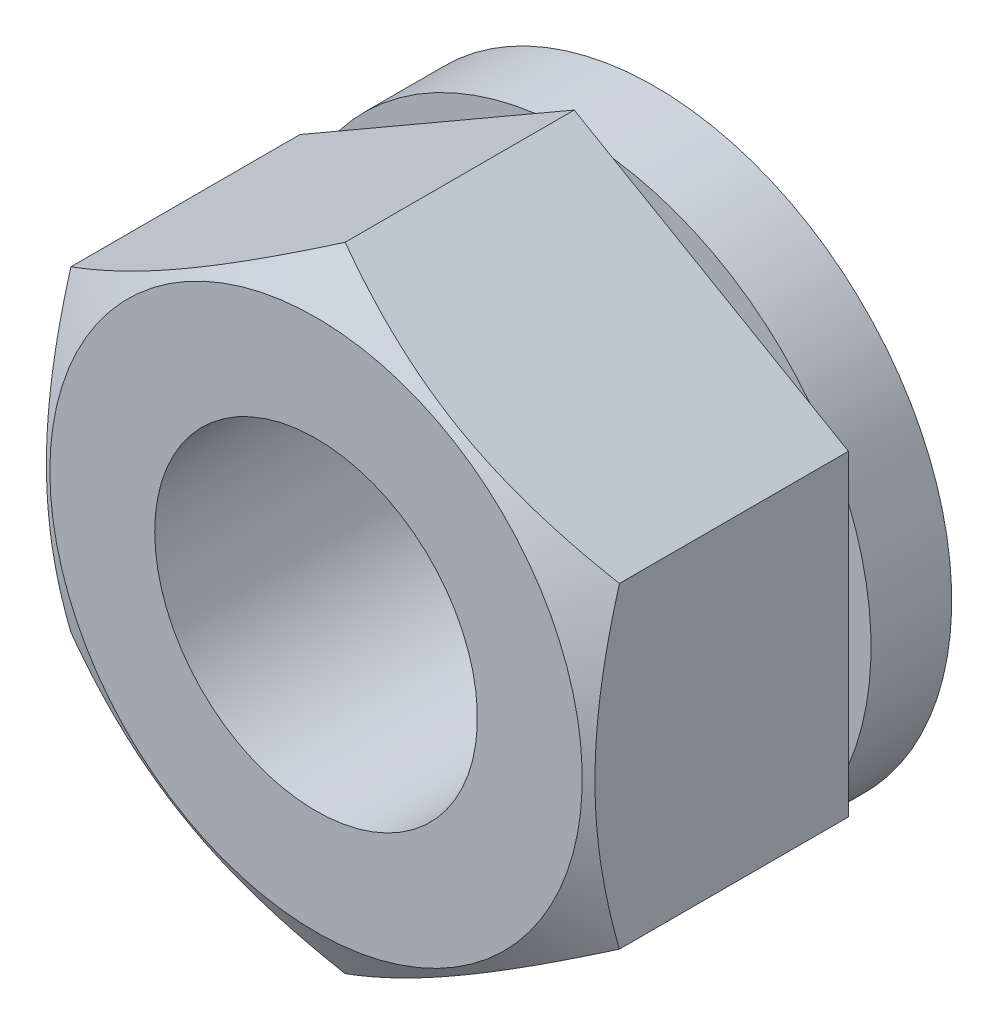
ISO-10303-21;
HEADER;
FILE_DESCRIPTION(('STEP AP214'),'2;1');
FILE_NAME('part.step','',(''),(''),'','','');
FILE_SCHEMA(('AUTOMOTIVE_DESIGN { 1 0 10303 214 1 1 1 1 }'));
ENDSEC;
DATA;
#1=APPLICATION_CONTEXT('core data for automotive mechanical design processes');
#2=APPLICATION_PROTOCOL_DEFINITION('international standard','automotive_design',2000,#1);
#3=PRODUCT_CONTEXT('',#1,'mechanical');
#4=PRODUCT('Part','Part','',(#3));
#5=PRODUCT_RELATED_PRODUCT_CATEGORY('part','',(#4));
#6=PRODUCT_DEFINITION_FORMATION('','',#4);
#7=PRODUCT_DEFINITION_CONTEXT('part definition',#1,'design');
#8=PRODUCT_DEFINITION('design','',#6,#7);
#9=PRODUCT_DEFINITION_SHAPE('','',#8);
#10=(LENGTH_UNIT() NAMED_UNIT(*) SI_UNIT(.MILLI.,.METRE.));
#11=(NAMED_UNIT(*) PLANE_ANGLE_UNIT() SI_UNIT($,.RADIAN.));
#12=(NAMED_UNIT(*) SI_UNIT($,.STERADIAN.) SOLID_ANGLE_UNIT());
#13=UNCERTAINTY_MEASURE_WITH_UNIT(LENGTH_MEASURE(1.E-05),#10,'distance_accuracy_value','');
#14=(GEOMETRIC_REPRESENTATION_CONTEXT(3) GLOBAL_UNCERTAINTY_ASSIGNED_CONTEXT((#13)) GLOBAL_UNIT_ASSIGNED_CONTEXT((#10,
#11,#12)) REPRESENTATION_CONTEXT('',''));
#15=CARTESIAN_POINT('',(0.,0.,0.));
#16=DIRECTION('',(0.,0.,1.));
#17=DIRECTION('',(1.,0.,0.));
#18=AXIS2_PLACEMENT_3D('',#15,#16,#17);
#19=CARTESIAN_POINT('',(0.,0.,-0.5));
#20=DIRECTION('',(0.,0.,1.));
#21=DIRECTION('',(1.,0.,0.));
#22=AXIS2_PLACEMENT_3D('',#19,#20,#21);
#23=CYLINDRICAL_SURFACE('',#22,9.2);
#24=CARTESIAN_POINT('',(0.,0.,2.5));
#25=DIRECTION('',(0.,0.,1.));
#26=DIRECTION('',(1.,0.,0.));
#27=AXIS2_PLACEMENT_3D('',#24,#25,#26);
#28=CIRCLE('',#27,9.2);
#29=CARTESIAN_POINT('',(-7.2983602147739,-5.60124434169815,2.5));
#30=VERTEX_POINT('',#29);
#31=CARTESIAN_POINT('',(-8.49999999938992,-3.51994318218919,2.5));
#32=VERTEX_POINT('',#31);
#33=EDGE_CURVE('E210',#30,#32,#28,.F.);
#34=ORIENTED_EDGE('',*,*,#33,.T.);
#35=CARTESIAN_POINT('',(0.,0.,2.5));
#36=DIRECTION('',(0.,0.,1.));
#37=DIRECTION('',(1.,0.,0.));
#38=AXIS2_PLACEMENT_3D('',#35,#36,#37);
#39=CIRCLE('',#38,9.2);
#40=CARTESIAN_POINT('',(-8.50000000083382,3.5199431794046,2.5));
#41=VERTEX_POINT('',#40);
#42=EDGE_CURVE('E207',#32,#41,#39,.F.);
#43=ORIENTED_EDGE('',*,*,#42,.T.);
#44=CARTESIAN_POINT('',(0.,0.,2.5));
#45=DIRECTION('',(0.,0.,1.));
#46=DIRECTION('',(1.,0.,0.));
#47=AXIS2_PLACEMENT_3D('',#44,#45,#46);
#48=CIRCLE('',#47,9.2);
#49=CARTESIAN_POINT('',(-7.29836021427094,5.60124434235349,2.5));
#50=VERTEX_POINT('',#49);
#51=EDGE_CURVE('E204',#41,#50,#48,.F.);
#52=ORIENTED_EDGE('',*,*,#51,.T.);
#53=CARTESIAN_POINT('',(0.,0.,2.5));
#54=DIRECTION('',(0.,0.,1.));
#55=DIRECTION('',(1.,0.,0.));
#56=AXIS2_PLACEMENT_3D('',#53,#54,#55);
#57=CIRCLE('',#56,9.2);
#58=CARTESIAN_POINT('',(-1.20163978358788,9.1211875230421,2.5));
#59=VERTEX_POINT('',#58);
#60=EDGE_CURVE('E201',#50,#59,#57,.F.);
#61=ORIENTED_EDGE('',*,*,#60,.T.);
#62=CARTESIAN_POINT('',(0.,0.,2.5));
#63=DIRECTION('',(0.,0.,1.));
#64=DIRECTION('',(1.,0.,0.));
#65=AXIS2_PLACEMENT_3D('',#62,#63,#64);
#66=CIRCLE('',#65,9.2);
#67=CARTESIAN_POINT('',(1.20163978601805,9.12118752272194,2.5));
#68=VERTEX_POINT('',#67);
#69=EDGE_CURVE('E198',#59,#68,#66,.F.);
#70=ORIENTED_EDGE('',*,*,#69,.T.);
#71=CARTESIAN_POINT('',(0.,0.,2.5));
#72=DIRECTION('',(0.,0.,1.));
#73=DIRECTION('',(1.,0.,0.));
#74=AXIS2_PLACEMENT_3D('',#71,#72,#73);
#75=CIRCLE('',#74,9.2);
#76=CARTESIAN_POINT('',(7.29836021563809,5.60124434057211,2.5));
#77=VERTEX_POINT('',#76);
#78=EDGE_CURVE('E195',#68,#77,#75,.F.);
#79=ORIENTED_EDGE('',*,*,#78,.T.);
#80=CARTESIAN_POINT('',(0.,0.,2.5));
#81=DIRECTION('',(0.,0.,1.));
#82=DIRECTION('',(1.,0.,0.));
#83=AXIS2_PLACEMENT_3D('',#80,#81,#82);
#84=CIRCLE('',#83,9.2);
#85=CARTESIAN_POINT('',(8.5,3.51994318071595,2.5));
#86=VERTEX_POINT('',#85);
#87=EDGE_CURVE('E193',#77,#86,#84,.F.);
#88=ORIENTED_EDGE('',*,*,#87,.T.);
#89=CARTESIAN_POINT('',(0.,0.,2.5));
#90=DIRECTION('',(0.,0.,1.));
#91=DIRECTION('',(1.,0.,0.));
#92=AXIS2_PLACEMENT_3D('',#89,#90,#91);
#93=CIRCLE('',#92,9.2);
#94=CARTESIAN_POINT('',(8.4999999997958,-3.51994318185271,2.5));
#95=VERTEX_POINT('',#94);
#96=EDGE_CURVE('E23',#86,#95,#93,.F.);
#97=ORIENTED_EDGE('',*,*,#96,.T.);
#98=CARTESIAN_POINT('',(0.,0.,2.5));
#99=DIRECTION('',(0.,0.,1.));
#100=DIRECTION('',(1.,0.,0.));
#101=AXIS2_PLACEMENT_3D('',#98,#99,#100);
#102=CIRCLE('',#101,9.2);
#103=CARTESIAN_POINT('',(7.2983602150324,-5.60124434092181,2.5));
#104=VERTEX_POINT('',#103);
#105=EDGE_CURVE('E112',#95,#104,#102,.F.);
#106=ORIENTED_EDGE('',*,*,#105,.T.);
#107=CARTESIAN_POINT('',(0.,0.,2.5));
#108=DIRECTION('',(0.,0.,1.));
#109=DIRECTION('',(1.,0.,0.));
#110=AXIS2_PLACEMENT_3D('',#107,#108,#109);
#111=CIRCLE('',#110,9.2);
#112=CARTESIAN_POINT('',(1.20163978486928,-9.12118752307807,2.5));
#113=VERTEX_POINT('',#112);
#114=EDGE_CURVE('E116',#104,#113,#111,.F.);
#115=ORIENTED_EDGE('',*,*,#114,.T.);
#116=CARTESIAN_POINT('',(0.,0.,2.5));
#117=DIRECTION('',(0.,0.,1.));
#118=DIRECTION('',(1.,0.,0.));
#119=AXIS2_PLACEMENT_3D('',#116,#117,#118);
#120=CIRCLE('',#119,9.2);
#121=CARTESIAN_POINT('',(-1.20163978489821,-9.12118752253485,2.5));
#122=VERTEX_POINT('',#121);
#123=EDGE_CURVE('E120',#113,#122,#120,.F.);
#124=ORIENTED_EDGE('',*,*,#123,.T.);
#125=CARTESIAN_POINT('',(0.,0.,2.5));
#126=DIRECTION('',(0.,0.,1.));
#127=DIRECTION('',(1.,0.,0.));
#128=AXIS2_PLACEMENT_3D('',#125,#126,#127);
#129=CIRCLE('',#128,9.2);
#130=EDGE_CURVE('E212',#122,#30,#129,.F.);
#131=ORIENTED_EDGE('',*,*,#130,.T.);
#132=EDGE_LOOP('',(#34,#43,#52,#61,#70,#79,#88,#97,#106,#115,#124,#131));
#133=FACE_BOUND('',#132,.T.);
#134=CARTESIAN_POINT('',(0.,0.,0.));
#135=DIRECTION('',(0.,0.,-1.));
#136=DIRECTION('',(-1.,0.,0.));
#137=AXIS2_PLACEMENT_3D('',#134,#135,#136);
#138=CIRCLE('',#137,9.2);
#139=CARTESIAN_POINT('',(-9.2,0.,0.));
#140=VERTEX_POINT('',#139);
#141=EDGE_CURVE('E540',#140,#140,#138,.T.);
#142=ORIENTED_EDGE('',*,*,#141,.F.);
#143=EDGE_LOOP('',(#142));
#144=FACE_BOUND('',#143,.T.);
#145=ADVANCED_FACE('F14',(#133,#144),#23,.T.);
#146=CARTESIAN_POINT('',(0.,0.,2.5));
#147=DIRECTION('',(0.,0.,-1.));
#148=DIRECTION('',(-1.,0.,0.));
#149=AXIS2_PLACEMENT_3D('',#146,#147,#148);
#150=CYLINDRICAL_SURFACE('',#149,5.1);
#151=CARTESIAN_POINT('',(0.,0.,2.5));
#152=DIRECTION('',(0.,0.,-1.));
#153=DIRECTION('',(-1.,0.,0.));
#154=AXIS2_PLACEMENT_3D('',#151,#152,#153);
#155=CIRCLE('',#154,5.1);
#156=CARTESIAN_POINT('',(-5.1,0.,2.5));
#157=VERTEX_POINT('',#156);
#158=EDGE_CURVE('E536',#157,#157,#155,.T.);
#159=ORIENTED_EDGE('',*,*,#158,.F.);
#160=EDGE_LOOP('',(#159));
#161=FACE_BOUND('',#160,.T.);
#162=CARTESIAN_POINT('',(0.,0.,0.));
#163=DIRECTION('',(0.,0.,-1.));
#164=DIRECTION('',(-1.,0.,0.));
#165=AXIS2_PLACEMENT_3D('',#162,#163,#164);
#166=CIRCLE('',#165,5.1);
#167=CARTESIAN_POINT('',(-5.1,0.,0.));
#168=VERTEX_POINT('',#167);
#169=EDGE_CURVE('E18',#168,#168,#166,.F.);
#170=ORIENTED_EDGE('',*,*,#169,.F.);
#171=EDGE_LOOP('',(#170));
#172=FACE_BOUND('',#171,.T.);
#173=ADVANCED_FACE('F280',(#161,#172),#150,.F.);
#174=CARTESIAN_POINT('',(0.,0.,10.5));
#175=DIRECTION('',(0.,0.,-1.));
#176=DIRECTION('',(-1.,0.,0.));
#177=AXIS2_PLACEMENT_3D('',#174,#175,#176);
#178=CYLINDRICAL_SURFACE('',#177,5.);
#179=CARTESIAN_POINT('',(0.,0.,10.5));
#180=DIRECTION('',(0.,0.,-1.));
#181=DIRECTION('',(-1.,0.,0.));
#182=AXIS2_PLACEMENT_3D('',#179,#180,#181);
#183=CIRCLE('',#182,5.);
#184=CARTESIAN_POINT('',(-5.,0.,10.5));
#185=VERTEX_POINT('',#184);
#186=EDGE_CURVE('E158',#185,#185,#183,.T.);
#187=ORIENTED_EDGE('',*,*,#186,.F.);
#188=EDGE_LOOP('',(#187));
#189=FACE_BOUND('',#188,.T.);
#190=CARTESIAN_POINT('',(0.,0.,2.5));
#191=DIRECTION('',(0.,0.,-1.));
#192=DIRECTION('',(-1.,0.,0.));
#193=AXIS2_PLACEMENT_3D('',#190,#191,#192);
#194=CIRCLE('',#193,5.);
#195=CARTESIAN_POINT('',(-5.,0.,2.5));
#196=VERTEX_POINT('',#195);
#197=EDGE_CURVE('E533',#196,#196,#194,.T.);
#198=ORIENTED_EDGE('',*,*,#197,.T.);
#199=EDGE_LOOP('',(#198));
#200=FACE_BOUND('',#199,.T.);
#201=ADVANCED_FACE('F286',(#189,#200),#178,.F.);
#202=CARTESIAN_POINT('',(8.5,-9.932734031,10.5));
#203=DIRECTION('',(0.,0.,-1.));
#204=DIRECTION('',(-1.,0.,0.));
#205=AXIS2_PLACEMENT_3D('',#202,#203,#204);
#206=PLANE('',#205);
#207=CARTESIAN_POINT('',(0.,0.,10.5));
#208=DIRECTION('',(0.,0.,-1.));
#209=DIRECTION('',(-1.,0.,0.));
#210=AXIS2_PLACEMENT_3D('',#207,#208,#209);
#211=CIRCLE('',#210,8.25);
#212=CARTESIAN_POINT('',(-8.25,0.,10.5));
#213=VERTEX_POINT('',#212);
#214=EDGE_CURVE('E538',#213,#213,#211,.T.);
#215=ORIENTED_EDGE('',*,*,#214,.F.);
#216=EDGE_LOOP('',(#215));
#217=FACE_BOUND('',#216,.T.);
#218=ORIENTED_EDGE('',*,*,#186,.T.);
#219=EDGE_LOOP('',(#218));
#220=FACE_BOUND('',#219,.T.);
#221=ADVANCED_FACE('F291',(#217,#220),#206,.F.);
#222=CARTESIAN_POINT('',(8.5,-4.907477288,2.5));
#223=DIRECTION('',(-0.499999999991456,0.866025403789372,0.));
#224=DIRECTION('',(-0.866025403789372,-0.499999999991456,0.));
#225=AXIS2_PLACEMENT_3D('',#222,#223,#224);
#226=PLANE('',#225);
#227=DIRECTION('',(0.,0.,1.));
#228=VECTOR('',#227,1.);
#229=CARTESIAN_POINT('',(8.5,-4.907477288,6.5));
#230=LINE('',#229,#228);
#231=CARTESIAN_POINT('',(8.5,-4.90747728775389,2.5));
#232=VERTEX_POINT('',#231);
#233=CARTESIAN_POINT('',(8.5,-4.907477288,9.59647305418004));
#234=VERTEX_POINT('',#233);
#235=EDGE_CURVE('E165',#232,#234,#230,.T.);
#236=ORIENTED_EDGE('',*,*,#235,.T.);
#237=CARTESIAN_POINT('',(8.5003,-4.90730408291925,9.59637305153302));
#238=CARTESIAN_POINT('',(8.31345993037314,-5.01517624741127,9.65864433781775));
#239=CARTESIAN_POINT('',(8.12592325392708,-5.12345059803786,9.71808959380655));
#240=CARTESIAN_POINT('',(7.74932684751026,-5.3408786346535,9.83054966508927));
#241=CARTESIAN_POINT('',(7.5602664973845,-5.45003267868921,9.88356170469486));
#242=CARTESIAN_POINT('',(6.99005829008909,-5.77924254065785,10.0319073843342));
#243=CARTESIAN_POINT('',(6.60665954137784,-6.00059791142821,10.1162849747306));
#244=CARTESIAN_POINT('',(6.03291070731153,-6.33185195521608,10.2152285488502));
#245=CARTESIAN_POINT('',(5.84427473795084,-6.44076098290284,10.2434148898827));
#246=CARTESIAN_POINT('',(5.46614968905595,-6.65907158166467,10.2906790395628));
#247=CARTESIAN_POINT('',(5.27666068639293,-6.76847310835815,10.309757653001));
#248=CARTESIAN_POINT('',(4.89735637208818,-6.98746455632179,10.338322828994));
#249=CARTESIAN_POINT('',(4.70754167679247,-7.09705412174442,10.3478202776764));
#250=CARTESIAN_POINT('',(4.32773688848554,-7.31633451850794,10.3570195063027));
#251=CARTESIAN_POINT('',(4.13774680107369,-7.42602534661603,10.3567215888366));
#252=CARTESIAN_POINT('',(3.78254745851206,-7.63109978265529,10.3470110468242));
#253=CARTESIAN_POINT('',(3.61731314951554,-7.72649785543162,10.3387829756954));
#254=CARTESIAN_POINT('',(3.28723151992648,-7.91707057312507,10.3150774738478));
#255=CARTESIAN_POINT('',(3.12238422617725,-8.0122452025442,10.2995995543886));
#256=CARTESIAN_POINT('',(2.62848051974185,-8.29740064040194,10.24265690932));
#257=CARTESIAN_POINT('',(2.30029837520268,-8.48687668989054,10.1906904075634));
#258=CARTESIAN_POINT('',(1.64045254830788,-8.86783885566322,10.0607720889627));
#259=CARTESIAN_POINT('',(1.30887308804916,-9.05927634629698,9.9822694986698));
#260=CARTESIAN_POINT('',(0.650659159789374,-9.43929633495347,9.80410061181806));
#261=CARTESIAN_POINT('',(0.324016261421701,-9.62788370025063,9.70447616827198));
#262=CARTESIAN_POINT('',(-0.000300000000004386,-9.81512778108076,9.59637305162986));
#263=B_SPLINE_CURVE_WITH_KNOTS('',3,(#237,#238,#239,#240,#241,#242,#243,#244,#245,#246,#247,
#248,#249,#250,#251,#252,#253,#254,#255,#256,#257,#258,#259,#260,#261,#262),.UNSPECIFIED.,.F.,
.F.,(4,2,2,2,2,2,2,2,2,2,2,2,4),(0.,0.673600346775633,1.3474903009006,2.69807034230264,
3.35681955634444,4.01551055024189,4.67345229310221,5.33137371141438,5.90415137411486,
6.4769676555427,7.62341628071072,8.79529237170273,9.96486773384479),.UNSPECIFIED.);
#264=CARTESIAN_POINT('',(0.,-9.814954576,9.59647305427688));
#265=VERTEX_POINT('',#264);
#266=EDGE_CURVE('E31',#234,#265,#263,.T.);
#267=ORIENTED_EDGE('',*,*,#266,.T.);
#268=DIRECTION('',(0.,0.,-1.));
#269=VECTOR('',#268,1.);
#270=CARTESIAN_POINT('',(0.,-9.814954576,6.5));
#271=LINE('',#270,#269);
#272=CARTESIAN_POINT('',(5.49695380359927E-11,-9.8149545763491,2.5));
#273=VERTEX_POINT('',#272);
#274=EDGE_CURVE('E162',#265,#273,#271,.T.);
#275=ORIENTED_EDGE('',*,*,#274,.T.);
#276=DIRECTION('',(-0.866025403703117,-0.500000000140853,0.));
#277=VECTOR('',#276,1.);
#278=CARTESIAN_POINT('',(1.20163978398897,-9.12118752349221,2.5));
#279=LINE('',#278,#277);
#280=EDGE_CURVE('E103',#113,#273,#279,.T.);
#281=ORIENTED_EDGE('',*,*,#280,.F.);
#282=DIRECTION('',(-0.866025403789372,-0.499999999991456,0.));
#283=VECTOR('',#282,1.);
#284=CARTESIAN_POINT('',(8.5,-4.907477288,2.5));
#285=LINE('',#284,#283);
#286=EDGE_CURVE('E96',#113,#104,#285,.F.);
#287=ORIENTED_EDGE('',*,*,#286,.T.);
#288=DIRECTION('',(-0.866025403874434,-0.499999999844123,0.));
#289=VECTOR('',#288,1.);
#290=CARTESIAN_POINT('',(8.5,-4.90747728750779,2.5));
#291=LINE('',#290,#289);
#292=EDGE_CURVE('E100',#232,#104,#291,.T.);
#293=ORIENTED_EDGE('',*,*,#292,.F.);
#294=EDGE_LOOP('',(#236,#267,#275,#281,#287,#293));
#295=FACE_BOUND('',#294,.T.);
#296=ADVANCED_FACE('F99',(#295),#226,.F.);
#297=CARTESIAN_POINT('',(0.,-9.814954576,2.5));
#298=DIRECTION('',(0.499999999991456,0.866025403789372,0.));
#299=DIRECTION('',(-0.866025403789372,0.499999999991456,0.));
#300=AXIS2_PLACEMENT_3D('',#297,#298,#299);
#301=PLANE('',#300);
#302=ORIENTED_EDGE('',*,*,#274,.F.);
#303=CARTESIAN_POINT('',(0.000300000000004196,-9.81512778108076,9.59637305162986));
#304=CARTESIAN_POINT('',(-0.186540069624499,-9.7072556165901,9.65864433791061));
#305=CARTESIAN_POINT('',(-0.374076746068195,-9.59898126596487,9.71808959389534));
#306=CARTESIAN_POINT('',(-0.75067315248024,-9.38155322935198,9.83054966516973));
#307=CARTESIAN_POINT('',(-0.93973350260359,-9.27239918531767,9.88356170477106));
#308=CARTESIAN_POINT('',(-1.50994170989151,-8.94318932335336,10.0319073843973));
#309=CARTESIAN_POINT('',(-1.89334045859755,-8.721833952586,10.1162849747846));
#310=CARTESIAN_POINT('',(-2.46708929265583,-8.39057990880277,10.2152285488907));
#311=CARTESIAN_POINT('',(-2.6557252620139,-8.28167088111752,10.2434148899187));
#312=CARTESIAN_POINT('',(-3.03385031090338,-8.06336028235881,10.29067903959));
#313=CARTESIAN_POINT('',(-3.22333931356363,-7.95395875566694,10.3097576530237));
#314=CARTESIAN_POINT('',(-3.60264362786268,-7.73496730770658,10.3383228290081));
#315=CARTESIAN_POINT('',(-3.79245832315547,-7.62537774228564,10.3478202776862));
#316=CARTESIAN_POINT('',(-4.1722631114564,-7.40609734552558,10.3570195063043));
#317=CARTESIAN_POINT('',(-4.36225319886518,-7.29640651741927,10.3567215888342));
#318=CARTESIAN_POINT('',(-4.71745254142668,-7.09133208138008,10.3470110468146));
#319=CARTESIAN_POINT('',(-4.88268685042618,-6.99593400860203,10.3387829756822));
#320=CARTESIAN_POINT('',(-5.21276848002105,-6.80536129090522,10.3150774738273));
#321=CARTESIAN_POINT('',(-5.37761577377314,-6.71018666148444,10.2995995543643));
#322=CARTESIAN_POINT('',(-5.87151948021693,-6.42503122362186,10.2426569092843));
#323=CARTESIAN_POINT('',(-6.19970162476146,-6.23555517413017,10.19069040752));
#324=CARTESIAN_POINT('',(-6.85954745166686,-5.85459300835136,10.0607720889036));
#325=CARTESIAN_POINT('',(-7.19112691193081,-5.66315551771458,9.98226949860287));
#326=CARTESIAN_POINT('',(-7.84934084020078,-5.28313552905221,9.80410061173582));
#327=CARTESIAN_POINT('',(-8.17598373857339,-5.0945481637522,9.70447616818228));
#328=CARTESIAN_POINT('',(-8.5003,-4.90730408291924,9.59637305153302));
#329=B_SPLINE_CURVE_WITH_KNOTS('',3,(#303,#304,#305,#306,#307,#308,#309,#310,#311,#312,#313,
#314,#315,#316,#317,#318,#319,#320,#321,#322,#323,#324,#325,#326,#327,#328),.UNSPECIFIED.,.F.,
.F.,(4,2,2,2,2,2,2,2,2,2,2,2,4),(0.,0.673600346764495,1.34749030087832,2.69807034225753,
3.3568195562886,4.01551055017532,4.67345229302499,5.33137371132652,5.90415137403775,
6.47696765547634,7.62341628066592,8.79529237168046,9.9648677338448),.UNSPECIFIED.);
#330=CARTESIAN_POINT('',(-8.5,-4.907477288,9.59647305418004));
#331=VERTEX_POINT('',#330);
#332=EDGE_CURVE('E308',#265,#331,#329,.T.);
#333=ORIENTED_EDGE('',*,*,#332,.T.);
#334=DIRECTION('',(0.,0.,-1.));
#335=VECTOR('',#334,1.);
#336=CARTESIAN_POINT('',(-8.5,-4.907477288,6.5));
#337=LINE('',#336,#335);
#338=CARTESIAN_POINT('',(-8.5,-4.90747728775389,2.5));
#339=VERTEX_POINT('',#338);
#340=EDGE_CURVE('E161',#331,#339,#337,.T.);
#341=ORIENTED_EDGE('',*,*,#340,.T.);
#342=DIRECTION('',(-0.866025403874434,0.499999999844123,0.));
#343=VECTOR('',#342,1.);
#344=CARTESIAN_POINT('',(-7.2983602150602,-5.60124434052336,2.5));
#345=LINE('',#344,#343);
#346=EDGE_CURVE('E148',#30,#339,#345,.T.);
#347=ORIENTED_EDGE('',*,*,#346,.F.);
#348=DIRECTION('',(-0.866025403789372,0.499999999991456,0.));
#349=VECTOR('',#348,1.);
#350=CARTESIAN_POINT('',(0.,-9.814954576,2.5));
#351=LINE('',#350,#349);
#352=EDGE_CURVE('E152',#30,#122,#351,.F.);
#353=ORIENTED_EDGE('',*,*,#352,.T.);
#354=DIRECTION('',(-0.866025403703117,0.500000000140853,0.));
#355=VECTOR('',#354,1.);
#356=CARTESIAN_POINT('',(0.,-9.81495457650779,2.5));
#357=LINE('',#356,#355);
#358=EDGE_CURVE('E154',#273,#122,#357,.T.);
#359=ORIENTED_EDGE('',*,*,#358,.F.);
#360=EDGE_LOOP('',(#302,#333,#341,#347,#353,#359));
#361=FACE_BOUND('',#360,.T.);
#362=ADVANCED_FACE('F299',(#361),#301,.F.);
#363=CARTESIAN_POINT('',(-8.5,-4.907477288,10.5));
#364=DIRECTION('',(1.,0.,0.));
#365=DIRECTION('',(0.,0.,-1.));
#366=AXIS2_PLACEMENT_3D('',#363,#364,#365);
#367=PLANE('',#366);
#368=ORIENTED_EDGE('',*,*,#340,.F.);
#369=CARTESIAN_POINT('',(-8.5,-4.907777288,9.5963864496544));
#370=CARTESIAN_POINT('',(-8.5,-4.69203334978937,9.65865718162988));
#371=CARTESIAN_POINT('',(-8.5,-4.47548504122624,9.71810186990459));
#372=CARTESIAN_POINT('',(-8.5,-4.04062976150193,9.83056078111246));
#373=CARTESIAN_POINT('',(-8.5,-3.82232207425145,9.88357222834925));
#374=CARTESIAN_POINT('',(-8.5,-3.16390359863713,10.031916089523));
#375=CARTESIAN_POINT('',(-8.5,-2.72119372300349,10.1162924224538));
#376=CARTESIAN_POINT('',(-8.5,-2.05868693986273,10.2152341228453));
#377=CARTESIAN_POINT('',(-8.5,-1.8408692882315,10.243419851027));
#378=CARTESIAN_POINT('',(-8.5,-1.40424892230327,10.2906827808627));
#379=CARTESIAN_POINT('',(-8.5,-1.18544629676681,10.309760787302));
#380=CARTESIAN_POINT('',(-8.5,-0.747464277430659,10.3383247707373));
#381=CARTESIAN_POINT('',(-8.5,-0.528285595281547,10.3478216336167));
#382=CARTESIAN_POINT('',(-8.5,-0.0897257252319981,10.3570197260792));
#383=CARTESIAN_POINT('',(-8.5,0.129655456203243,10.35672125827));
#384=CARTESIAN_POINT('',(-8.5,0.539800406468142,10.3470098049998));
#385=CARTESIAN_POINT('',(-8.5,0.730593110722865,10.3387814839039));
#386=CARTESIAN_POINT('',(-8.5,1.11173166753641,10.3150757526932));
#387=CARTESIAN_POINT('',(-8.5,1.30207748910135,10.2995978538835));
#388=CARTESIAN_POINT('',(-8.5,1.87237805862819,10.2426556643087));
#389=CARTESIAN_POINT('',(-8.5,2.25132331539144,10.1906899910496));
#390=CARTESIAN_POINT('',(-8.5,3.01323376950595,10.0607742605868));
#391=CARTESIAN_POINT('',(-8.5,3.39610172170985,9.98227346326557));
#392=CARTESIAN_POINT('',(-8.5,4.1561278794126,9.8041088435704));
#393=CARTESIAN_POINT('',(-8.5,4.53329581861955,9.70448687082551));
#394=CARTESIAN_POINT('',(-8.5,4.907777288,9.5963864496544));
#395=B_SPLINE_CURVE_WITH_KNOTS('',3,(#369,#370,#371,#372,#373,#374,#375,#376,#377,#378,#379,
#380,#381,#382,#383,#384,#385,#386,#387,#388,#389,#390,#391,#392,#393,#394),.UNSPECIFIED.,.F.,
.F.,(4,2,2,2,2,2,2,2,2,2,2,2,4),(0.,0.673598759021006,1.34748712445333,2.69806390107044,
3.35681167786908,4.01550123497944,4.67344155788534,5.33136155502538,5.90412894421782,
6.47693494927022,7.62336295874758,8.79521734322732,9.96477115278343),.UNSPECIFIED.);
#396=CARTESIAN_POINT('',(-8.5,4.907477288,9.59647305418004));
#397=VERTEX_POINT('',#396);
#398=EDGE_CURVE('E339',#331,#397,#395,.T.);
#399=ORIENTED_EDGE('',*,*,#398,.T.);
#400=DIRECTION('',(0.,0.,-1.));
#401=VECTOR('',#400,1.);
#402=CARTESIAN_POINT('',(-8.5,4.907477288,6.5));
#403=LINE('',#402,#401);
#404=CARTESIAN_POINT('',(-8.5,4.90747728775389,2.5));
#405=VERTEX_POINT('',#404);
#406=EDGE_CURVE('E182',#397,#405,#403,.T.);
#407=ORIENTED_EDGE('',*,*,#406,.T.);
#408=DIRECTION('',(0.,1.,0.));
#409=VECTOR('',#408,1.);
#410=CARTESIAN_POINT('',(-8.5,4.560593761,2.5));
#411=LINE('',#410,#409);
#412=EDGE_CURVE('E147',#41,#405,#411,.T.);
#413=ORIENTED_EDGE('',*,*,#412,.F.);
#414=DIRECTION('',(0.,-1.,0.));
#415=VECTOR('',#414,1.);
#416=CARTESIAN_POINT('',(-8.5,0.,2.5));
#417=LINE('',#416,#415);
#418=EDGE_CURVE('E233',#41,#32,#417,.T.);
#419=ORIENTED_EDGE('',*,*,#418,.T.);
#420=DIRECTION('',(0.,1.,0.));
#421=VECTOR('',#420,1.);
#422=CARTESIAN_POINT('',(-8.5,-4.560593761,2.5));
#423=LINE('',#422,#421);
#424=EDGE_CURVE('E151',#339,#32,#423,.T.);
#425=ORIENTED_EDGE('',*,*,#424,.F.);
#426=EDGE_LOOP('',(#368,#399,#407,#413,#419,#425));
#427=FACE_BOUND('',#426,.T.);
#428=ADVANCED_FACE('F236',(#427),#367,.F.);
#429=CARTESIAN_POINT('',(-8.5,4.907477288,2.5));
#430=DIRECTION('',(0.499999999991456,-0.866025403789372,0.));
#431=DIRECTION('',(0.866025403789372,0.499999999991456,0.));
#432=AXIS2_PLACEMENT_3D('',#429,#430,#431);
#433=PLANE('',#432);
#434=ORIENTED_EDGE('',*,*,#406,.F.);
#435=CARTESIAN_POINT('',(-8.5003,4.90730408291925,9.59637305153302));
#436=CARTESIAN_POINT('',(-8.31345993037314,5.01517624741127,9.65864433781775));
#437=CARTESIAN_POINT('',(-8.12592325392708,5.12345059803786,9.71808959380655));
#438=CARTESIAN_POINT('',(-7.74932684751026,5.3408786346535,9.83054966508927));
#439=CARTESIAN_POINT('',(-7.5602664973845,5.45003267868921,9.88356170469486));
#440=CARTESIAN_POINT('',(-6.99005829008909,5.77924254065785,10.0319073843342));
#441=CARTESIAN_POINT('',(-6.60665954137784,6.00059791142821,10.1162849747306));
#442=CARTESIAN_POINT('',(-6.03291070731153,6.33185195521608,10.2152285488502));
#443=CARTESIAN_POINT('',(-5.84427473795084,6.44076098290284,10.2434148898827));
#444=CARTESIAN_POINT('',(-5.46614968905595,6.65907158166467,10.2906790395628));
#445=CARTESIAN_POINT('',(-5.27666068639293,6.76847310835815,10.309757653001));
#446=CARTESIAN_POINT('',(-4.89735637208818,6.98746455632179,10.338322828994));
#447=CARTESIAN_POINT('',(-4.70754167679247,7.09705412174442,10.3478202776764));
#448=CARTESIAN_POINT('',(-4.32773688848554,7.31633451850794,10.3570195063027));
#449=CARTESIAN_POINT('',(-4.13774680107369,7.42602534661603,10.3567215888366));
#450=CARTESIAN_POINT('',(-3.78254745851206,7.63109978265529,10.3470110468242));
#451=CARTESIAN_POINT('',(-3.61731314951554,7.72649785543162,10.3387829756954));
#452=CARTESIAN_POINT('',(-3.28723151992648,7.91707057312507,10.3150774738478));
#453=CARTESIAN_POINT('',(-3.12238422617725,8.0122452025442,10.2995995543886));
#454=CARTESIAN_POINT('',(-2.62848051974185,8.29740064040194,10.24265690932));
#455=CARTESIAN_POINT('',(-2.30029837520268,8.48687668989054,10.1906904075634));
#456=CARTESIAN_POINT('',(-1.64045254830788,8.86783885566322,10.0607720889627));
#457=CARTESIAN_POINT('',(-1.30887308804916,9.05927634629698,9.9822694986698));
#458=CARTESIAN_POINT('',(-0.650659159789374,9.43929633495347,9.80410061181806));
#459=CARTESIAN_POINT('',(-0.324016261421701,9.62788370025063,9.70447616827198));
#460=CARTESIAN_POINT('',(0.000300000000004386,9.81512778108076,9.59637305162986));
#461=B_SPLINE_CURVE_WITH_KNOTS('',3,(#435,#436,#437,#438,#439,#440,#441,#442,#443,#444,#445,
#446,#447,#448,#449,#450,#451,#452,#453,#454,#455,#456,#457,#458,#459,#460),.UNSPECIFIED.,.F.,
.F.,(4,2,2,2,2,2,2,2,2,2,2,2,4),(0.,0.673600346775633,1.3474903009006,2.69807034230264,
3.35681955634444,4.01551055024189,4.67345229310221,5.33137371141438,5.90415137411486,
6.4769676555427,7.62341628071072,8.79529237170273,9.96486773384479),.UNSPECIFIED.);
#462=CARTESIAN_POINT('',(0.,9.814954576,9.59647305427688));
#463=VERTEX_POINT('',#462);
#464=EDGE_CURVE('E333',#397,#463,#461,.T.);
#465=ORIENTED_EDGE('',*,*,#464,.T.);
#466=DIRECTION('',(0.,0.,-1.));
#467=VECTOR('',#466,1.);
#468=CARTESIAN_POINT('',(0.,9.814954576,6.5));
#469=LINE('',#468,#467);
#470=CARTESIAN_POINT('',(5.49693636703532E-11,9.8149545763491,2.5));
#471=VERTEX_POINT('',#470);
#472=EDGE_CURVE('E180',#463,#471,#469,.T.);
#473=ORIENTED_EDGE('',*,*,#472,.T.);
#474=DIRECTION('',(0.866025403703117,0.500000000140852,0.));
#475=VECTOR('',#474,1.);
#476=CARTESIAN_POINT('',(-1.20163978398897,9.12118752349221,2.5));
#477=LINE('',#476,#475);
#478=EDGE_CURVE('E139',#59,#471,#477,.T.);
#479=ORIENTED_EDGE('',*,*,#478,.F.);
#480=DIRECTION('',(0.866025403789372,0.499999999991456,0.));
#481=VECTOR('',#480,1.);
#482=CARTESIAN_POINT('',(-8.5,4.907477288,2.5));
#483=LINE('',#482,#481);
#484=EDGE_CURVE('E142',#59,#50,#483,.F.);
#485=ORIENTED_EDGE('',*,*,#484,.T.);
#486=DIRECTION('',(0.866025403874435,0.499999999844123,0.));
#487=VECTOR('',#486,1.);
#488=CARTESIAN_POINT('',(-8.5,4.90747728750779,2.5));
#489=LINE('',#488,#487);
#490=EDGE_CURVE('E144',#405,#50,#489,.T.);
#491=ORIENTED_EDGE('',*,*,#490,.F.);
#492=EDGE_LOOP('',(#434,#465,#473,#479,#485,#491));
#493=FACE_BOUND('',#492,.T.);
#494=ADVANCED_FACE('F261',(#493),#433,.F.);
#495=CARTESIAN_POINT('',(0.,9.814954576,2.5));
#496=DIRECTION('',(-0.499999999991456,-0.866025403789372,0.));
#497=DIRECTION('',(0.866025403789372,-0.499999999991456,0.));
#498=AXIS2_PLACEMENT_3D('',#495,#496,#497);
#499=PLANE('',#498);
#500=ORIENTED_EDGE('',*,*,#472,.F.);
#501=CARTESIAN_POINT('',(-0.000300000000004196,9.81512778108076,9.59637305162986));
#502=CARTESIAN_POINT('',(0.186540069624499,9.7072556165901,9.65864433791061));
#503=CARTESIAN_POINT('',(0.374076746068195,9.59898126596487,9.71808959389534));
#504=CARTESIAN_POINT('',(0.75067315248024,9.38155322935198,9.83054966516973));
#505=CARTESIAN_POINT('',(0.93973350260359,9.27239918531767,9.88356170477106));
#506=CARTESIAN_POINT('',(1.50994170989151,8.94318932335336,10.0319073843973));
#507=CARTESIAN_POINT('',(1.89334045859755,8.721833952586,10.1162849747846));
#508=CARTESIAN_POINT('',(2.46708929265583,8.39057990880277,10.2152285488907));
#509=CARTESIAN_POINT('',(2.6557252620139,8.28167088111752,10.2434148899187));
#510=CARTESIAN_POINT('',(3.03385031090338,8.06336028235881,10.29067903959));
#511=CARTESIAN_POINT('',(3.22333931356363,7.95395875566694,10.3097576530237));
#512=CARTESIAN_POINT('',(3.60264362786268,7.73496730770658,10.3383228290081));
#513=CARTESIAN_POINT('',(3.79245832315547,7.62537774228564,10.3478202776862));
#514=CARTESIAN_POINT('',(4.1722631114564,7.40609734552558,10.3570195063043));
#515=CARTESIAN_POINT('',(4.36225319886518,7.29640651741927,10.3567215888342));
#516=CARTESIAN_POINT('',(4.71745254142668,7.09133208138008,10.3470110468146));
#517=CARTESIAN_POINT('',(4.88268685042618,6.99593400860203,10.3387829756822));
#518=CARTESIAN_POINT('',(5.21276848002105,6.80536129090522,10.3150774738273));
#519=CARTESIAN_POINT('',(5.37761577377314,6.71018666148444,10.2995995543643));
#520=CARTESIAN_POINT('',(5.87151948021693,6.42503122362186,10.2426569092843));
#521=CARTESIAN_POINT('',(6.19970162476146,6.23555517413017,10.19069040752));
#522=CARTESIAN_POINT('',(6.85954745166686,5.85459300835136,10.0607720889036));
#523=CARTESIAN_POINT('',(7.19112691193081,5.66315551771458,9.98226949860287));
#524=CARTESIAN_POINT('',(7.84934084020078,5.28313552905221,9.80410061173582));
#525=CARTESIAN_POINT('',(8.17598373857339,5.0945481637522,9.70447616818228));
#526=CARTESIAN_POINT('',(8.5003,4.90730408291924,9.59637305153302));
#527=B_SPLINE_CURVE_WITH_KNOTS('',3,(#501,#502,#503,#504,#505,#506,#507,#508,#509,#510,#511,
#512,#513,#514,#515,#516,#517,#518,#519,#520,#521,#522,#523,#524,#525,#526),.UNSPECIFIED.,.F.,
.F.,(4,2,2,2,2,2,2,2,2,2,2,2,4),(0.,0.673600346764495,1.34749030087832,2.69807034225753,
3.3568195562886,4.01551055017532,4.67345229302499,5.33137371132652,5.90415137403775,
6.47696765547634,7.62341628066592,8.79529237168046,9.9648677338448),.UNSPECIFIED.);
#528=CARTESIAN_POINT('',(8.5,4.907477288,9.59647305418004));
#529=VERTEX_POINT('',#528);
#530=EDGE_CURVE('E324',#463,#529,#527,.T.);
#531=ORIENTED_EDGE('',*,*,#530,.T.);
#532=DIRECTION('',(0.,0.,-1.));
#533=VECTOR('',#532,1.);
#534=CARTESIAN_POINT('',(8.5,4.907477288,6.5));
#535=LINE('',#534,#533);
#536=CARTESIAN_POINT('',(8.5,4.90747728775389,2.5));
#537=VERTEX_POINT('',#536);
#538=EDGE_CURVE('E163',#529,#537,#535,.T.);
#539=ORIENTED_EDGE('',*,*,#538,.T.);
#540=DIRECTION('',(0.866025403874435,-0.499999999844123,0.));
#541=VECTOR('',#540,1.);
#542=CARTESIAN_POINT('',(7.2983602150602,5.60124434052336,2.5));
#543=LINE('',#542,#541);
#544=EDGE_CURVE('E131',#77,#537,#543,.T.);
#545=ORIENTED_EDGE('',*,*,#544,.F.);
#546=DIRECTION('',(0.866025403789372,-0.499999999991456,0.));
#547=VECTOR('',#546,1.);
#548=CARTESIAN_POINT('',(0.,9.814954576,2.5));
#549=LINE('',#548,#547);
#550=EDGE_CURVE('E134',#77,#68,#549,.F.);
#551=ORIENTED_EDGE('',*,*,#550,.T.);
#552=DIRECTION('',(0.866025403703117,-0.500000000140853,0.));
#553=VECTOR('',#552,1.);
#554=CARTESIAN_POINT('',(0.,9.81495457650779,2.5));
#555=LINE('',#554,#553);
#556=EDGE_CURVE('E136',#471,#68,#555,.T.);
#557=ORIENTED_EDGE('',*,*,#556,.F.);
#558=EDGE_LOOP('',(#500,#531,#539,#545,#551,#557));
#559=FACE_BOUND('',#558,.T.);
#560=ADVANCED_FACE('F255',(#559),#499,.F.);
#561=CARTESIAN_POINT('',(8.5,-4.907477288,2.5));
#562=DIRECTION('',(-1.,0.,0.));
#563=DIRECTION('',(0.,0.,1.));
#564=AXIS2_PLACEMENT_3D('',#561,#562,#563);
#565=PLANE('',#564);
#566=ORIENTED_EDGE('',*,*,#538,.F.);
#567=CARTESIAN_POINT('',(8.5,4.907777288,9.5963864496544));
#568=CARTESIAN_POINT('',(8.5,4.69203334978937,9.65865718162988));
#569=CARTESIAN_POINT('',(8.5,4.47548504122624,9.71810186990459));
#570=CARTESIAN_POINT('',(8.5,4.04062976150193,9.83056078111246));
#571=CARTESIAN_POINT('',(8.5,3.82232207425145,9.88357222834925));
#572=CARTESIAN_POINT('',(8.5,3.16390359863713,10.031916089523));
#573=CARTESIAN_POINT('',(8.5,2.72119372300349,10.1162924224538));
#574=CARTESIAN_POINT('',(8.5,2.05868693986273,10.2152341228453));
#575=CARTESIAN_POINT('',(8.5,1.8408692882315,10.243419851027));
#576=CARTESIAN_POINT('',(8.5,1.40424892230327,10.2906827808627));
#577=CARTESIAN_POINT('',(8.5,1.18544629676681,10.309760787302));
#578=CARTESIAN_POINT('',(8.5,0.747464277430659,10.3383247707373));
#579=CARTESIAN_POINT('',(8.5,0.528285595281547,10.3478216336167));
#580=CARTESIAN_POINT('',(8.5,0.0897257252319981,10.3570197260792));
#581=CARTESIAN_POINT('',(8.5,-0.129655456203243,10.35672125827));
#582=CARTESIAN_POINT('',(8.5,-0.539800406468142,10.3470098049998));
#583=CARTESIAN_POINT('',(8.5,-0.730593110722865,10.3387814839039));
#584=CARTESIAN_POINT('',(8.5,-1.11173166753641,10.3150757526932));
#585=CARTESIAN_POINT('',(8.5,-1.30207748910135,10.2995978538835));
#586=CARTESIAN_POINT('',(8.5,-1.87237805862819,10.2426556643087));
#587=CARTESIAN_POINT('',(8.5,-2.25132331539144,10.1906899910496));
#588=CARTESIAN_POINT('',(8.5,-3.01323376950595,10.0607742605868));
#589=CARTESIAN_POINT('',(8.5,-3.39610172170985,9.98227346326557));
#590=CARTESIAN_POINT('',(8.5,-4.1561278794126,9.8041088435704));
#591=CARTESIAN_POINT('',(8.5,-4.53329581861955,9.70448687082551));
#592=CARTESIAN_POINT('',(8.5,-4.907777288,9.5963864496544));
#593=B_SPLINE_CURVE_WITH_KNOTS('',3,(#567,#568,#569,#570,#571,#572,#573,#574,#575,#576,#577,
#578,#579,#580,#581,#582,#583,#584,#585,#586,#587,#588,#589,#590,#591,#592),.UNSPECIFIED.,.F.,
.F.,(4,2,2,2,2,2,2,2,2,2,2,2,4),(0.,0.673598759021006,1.34748712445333,2.69806390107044,
3.35681167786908,4.01550123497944,4.67344155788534,5.33136155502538,5.90412894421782,
6.47693494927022,7.62336295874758,8.79521734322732,9.96477115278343),.UNSPECIFIED.);
#594=EDGE_CURVE('E9',#529,#234,#593,.T.);
#595=ORIENTED_EDGE('',*,*,#594,.T.);
#596=ORIENTED_EDGE('',*,*,#235,.F.);
#597=DIRECTION('',(0.,-1.,0.));
#598=VECTOR('',#597,1.);
#599=CARTESIAN_POINT('',(8.5,-4.560593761,2.5));
#600=LINE('',#599,#598);
#601=EDGE_CURVE('E113',#95,#232,#600,.T.);
#602=ORIENTED_EDGE('',*,*,#601,.F.);
#603=DIRECTION('',(0.,1.,0.));
#604=VECTOR('',#603,1.);
#605=CARTESIAN_POINT('',(8.5,0.,2.5));
#606=LINE('',#605,#604);
#607=EDGE_CURVE('E39',#95,#86,#606,.T.);
#608=ORIENTED_EDGE('',*,*,#607,.T.);
#609=DIRECTION('',(0.,-1.,0.));
#610=VECTOR('',#609,1.);
#611=CARTESIAN_POINT('',(8.5,4.560593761,2.5));
#612=LINE('',#611,#610);
#613=EDGE_CURVE('E127',#537,#86,#612,.T.);
#614=ORIENTED_EDGE('',*,*,#613,.F.);
#615=EDGE_LOOP('',(#566,#595,#596,#602,#608,#614));
#616=FACE_BOUND('',#615,.T.);
#617=ADVANCED_FACE('F351',(#616),#565,.F.);
#618=CARTESIAN_POINT('',(8.5,-5.613732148,2.5));
#619=DIRECTION('',(0.,0.,-1.));
#620=DIRECTION('',(-1.,0.,0.));
#621=AXIS2_PLACEMENT_3D('',#618,#619,#620);
#622=PLANE('',#621);
#623=ORIENTED_EDGE('',*,*,#601,.T.);
#624=ORIENTED_EDGE('',*,*,#292,.T.);
#625=ORIENTED_EDGE('',*,*,#105,.F.);
#626=EDGE_LOOP('',(#623,#624,#625));
#627=FACE_BOUND('',#626,.T.);
#628=ADVANCED_FACE('F110',(#627),#622,.T.);
#629=CARTESIAN_POINT('',(7.334940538,-9.142307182,2.5));
#630=DIRECTION('',(0.,0.,-1.));
#631=DIRECTION('',(-1.,0.,0.));
#632=AXIS2_PLACEMENT_3D('',#629,#630,#631);
#633=PLANE('',#632);
#634=ORIENTED_EDGE('',*,*,#114,.F.);
#635=ORIENTED_EDGE('',*,*,#286,.F.);
#636=EDGE_LOOP('',(#634,#635));
#637=FACE_BOUND('',#636,.T.);
#638=ADVANCED_FACE('F117',(#637),#633,.F.);
#639=CARTESIAN_POINT('',(1.216059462,-9.819117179,2.5));
#640=DIRECTION('',(0.,0.,-1.));
#641=DIRECTION('',(-1.,0.,0.));
#642=AXIS2_PLACEMENT_3D('',#639,#640,#641);
#643=PLANE('',#642);
#644=ORIENTED_EDGE('',*,*,#280,.T.);
#645=ORIENTED_EDGE('',*,*,#358,.T.);
#646=ORIENTED_EDGE('',*,*,#123,.F.);
#647=EDGE_LOOP('',(#644,#645,#646));
#648=FACE_BOUND('',#647,.T.);
#649=ADVANCED_FACE('F216',(#648),#643,.T.);
#650=CARTESIAN_POINT('',(-1.165059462,-9.142307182,2.5));
#651=DIRECTION('',(0.,0.,-1.));
#652=DIRECTION('',(-1.,0.,0.));
#653=AXIS2_PLACEMENT_3D('',#650,#651,#652);
#654=PLANE('',#653);
#655=ORIENTED_EDGE('',*,*,#130,.F.);
#656=ORIENTED_EDGE('',*,*,#352,.F.);
#657=EDGE_LOOP('',(#655,#656));
#658=FACE_BOUND('',#657,.T.);
#659=ADVANCED_FACE('F222',(#658),#654,.F.);
#660=CARTESIAN_POINT('',(-7.291150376,-5.613732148,2.5));
#661=DIRECTION('',(0.,0.,-1.));
#662=DIRECTION('',(-1.,0.,0.));
#663=AXIS2_PLACEMENT_3D('',#660,#661,#662);
#664=PLANE('',#663);
#665=ORIENTED_EDGE('',*,*,#346,.T.);
#666=ORIENTED_EDGE('',*,*,#424,.T.);
#667=ORIENTED_EDGE('',*,*,#33,.F.);
#668=EDGE_LOOP('',(#665,#666,#667));
#669=FACE_BOUND('',#668,.T.);
#670=ADVANCED_FACE('F226',(#669),#664,.T.);
#671=CARTESIAN_POINT('',(-8.5,-3.5621825,2.5));
#672=DIRECTION('',(0.,0.,-1.));
#673=DIRECTION('',(-1.,0.,0.));
#674=AXIS2_PLACEMENT_3D('',#671,#672,#673);
#675=PLANE('',#674);
#676=ORIENTED_EDGE('',*,*,#42,.F.);
#677=ORIENTED_EDGE('',*,*,#418,.F.);
#678=EDGE_LOOP('',(#676,#677));
#679=FACE_BOUND('',#678,.T.);
#680=ADVANCED_FACE('F232',(#679),#675,.F.);
#681=CARTESIAN_POINT('',(-7.291150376,3.507455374,2.5));
#682=DIRECTION('',(0.,0.,-1.));
#683=DIRECTION('',(-1.,0.,0.));
#684=AXIS2_PLACEMENT_3D('',#681,#682,#683);
#685=PLANE('',#684);
#686=ORIENTED_EDGE('',*,*,#412,.T.);
#687=ORIENTED_EDGE('',*,*,#490,.T.);
#688=ORIENTED_EDGE('',*,*,#51,.F.);
#689=EDGE_LOOP('',(#686,#687,#688));
#690=FACE_BOUND('',#689,.T.);
#691=ADVANCED_FACE('F268',(#690),#685,.T.);
#692=CARTESIAN_POINT('',(-1.165059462,5.580124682,2.5));
#693=DIRECTION('',(0.,0.,-1.));
#694=DIRECTION('',(-1.,0.,0.));
#695=AXIS2_PLACEMENT_3D('',#692,#693,#694);
#696=PLANE('',#695);
#697=ORIENTED_EDGE('',*,*,#60,.F.);
#698=ORIENTED_EDGE('',*,*,#484,.F.);
#699=EDGE_LOOP('',(#697,#698));
#700=FACE_BOUND('',#699,.T.);
#701=ADVANCED_FACE('F266',(#700),#696,.F.);
#702=CARTESIAN_POINT('',(1.216059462,9.117024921,2.5));
#703=DIRECTION('',(0.,0.,-1.));
#704=DIRECTION('',(-1.,0.,0.));
#705=AXIS2_PLACEMENT_3D('',#702,#703,#704);
#706=PLANE('',#705);
#707=ORIENTED_EDGE('',*,*,#478,.T.);
#708=ORIENTED_EDGE('',*,*,#556,.T.);
#709=ORIENTED_EDGE('',*,*,#69,.F.);
#710=EDGE_LOOP('',(#707,#708,#709));
#711=FACE_BOUND('',#710,.T.);
#712=ADVANCED_FACE('F257',(#711),#706,.T.);
#713=CARTESIAN_POINT('',(7.334940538,5.580124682,2.5));
#714=DIRECTION('',(0.,0.,-1.));
#715=DIRECTION('',(-1.,0.,0.));
#716=AXIS2_PLACEMENT_3D('',#713,#714,#715);
#717=PLANE('',#716);
#718=ORIENTED_EDGE('',*,*,#78,.F.);
#719=ORIENTED_EDGE('',*,*,#550,.F.);
#720=EDGE_LOOP('',(#718,#719));
#721=FACE_BOUND('',#720,.T.);
#722=ADVANCED_FACE('F251',(#721),#717,.F.);
#723=CARTESIAN_POINT('',(8.5,3.507455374,2.5));
#724=DIRECTION('',(0.,0.,-1.));
#725=DIRECTION('',(-1.,0.,0.));
#726=AXIS2_PLACEMENT_3D('',#723,#724,#725);
#727=PLANE('',#726);
#728=ORIENTED_EDGE('',*,*,#544,.T.);
#729=ORIENTED_EDGE('',*,*,#613,.T.);
#730=ORIENTED_EDGE('',*,*,#87,.F.);
#731=EDGE_LOOP('',(#728,#729,#730));
#732=FACE_BOUND('',#731,.T.);
#733=ADVANCED_FACE('F244',(#732),#727,.T.);
#734=CARTESIAN_POINT('',(9.2042,-3.5621825,2.5));
#735=DIRECTION('',(0.,0.,-1.));
#736=DIRECTION('',(-1.,0.,0.));
#737=AXIS2_PLACEMENT_3D('',#734,#735,#736);
#738=PLANE('',#737);
#739=ORIENTED_EDGE('',*,*,#607,.F.);
#740=ORIENTED_EDGE('',*,*,#96,.F.);
#741=EDGE_LOOP('',(#739,#740));
#742=FACE_BOUND('',#741,.T.);
#743=ADVANCED_FACE('F16',(#742),#738,.F.);
#744=CARTESIAN_POINT('',(0.,0.,10.5));
#745=DIRECTION('',(0.,0.,-1.));
#746=DIRECTION('',(-1.,0.,0.));
#747=AXIS2_PLACEMENT_3D('',#744,#745,#746);
#748=CONICAL_SURFACE('',#747,8.25,1.0471975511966);
#749=ORIENTED_EDGE('',*,*,#214,.T.);
#750=EDGE_LOOP('',(#749));
#751=FACE_BOUND('',#750,.T.);
#752=ORIENTED_EDGE('',*,*,#594,.F.);
#753=ORIENTED_EDGE('',*,*,#530,.F.);
#754=ORIENTED_EDGE('',*,*,#464,.F.);
#755=ORIENTED_EDGE('',*,*,#398,.F.);
#756=ORIENTED_EDGE('',*,*,#332,.F.);
#757=ORIENTED_EDGE('',*,*,#266,.F.);
#758=EDGE_LOOP('',(#752,#753,#754,#755,#756,#757));
#759=FACE_BOUND('',#758,.T.);
#760=ADVANCED_FACE('F295',(#751,#759),#748,.T.);
#761=CARTESIAN_POINT('',(0.,0.,2.5));
#762=DIRECTION('',(0.,0.,-1.));
#763=DIRECTION('',(-1.,0.,0.));
#764=AXIS2_PLACEMENT_3D('',#761,#762,#763);
#765=PLANE('',#764);
#766=ORIENTED_EDGE('',*,*,#197,.F.);
#767=EDGE_LOOP('',(#766));
#768=FACE_BOUND('',#767,.T.);
#769=ORIENTED_EDGE('',*,*,#158,.T.);
#770=EDGE_LOOP('',(#769));
#771=FACE_BOUND('',#770,.T.);
#772=ADVANCED_FACE('F316',(#768,#771),#765,.T.);
#773=CARTESIAN_POINT('',(0.,0.,0.));
#774=DIRECTION('',(0.,0.,-1.));
#775=DIRECTION('',(-1.,0.,0.));
#776=AXIS2_PLACEMENT_3D('',#773,#774,#775);
#777=PLANE('',#776);
#778=ORIENTED_EDGE('',*,*,#141,.T.);
#779=EDGE_LOOP('',(#778));
#780=FACE_BOUND('',#779,.T.);
#781=ORIENTED_EDGE('',*,*,#169,.T.);
#782=EDGE_LOOP('',(#781));
#783=FACE_BOUND('',#782,.T.);
#784=ADVANCED_FACE('F490',(#780,#783),#777,.T.);
#785=CLOSED_SHELL('',(#145,#173,#201,#221,#296,#362,#428,#494,#560,#617,#628,#638,#649,#659,
#670,#680,#691,#701,#712,#722,#733,#743,#760,#772,#784));
#786=MANIFOLD_SOLID_BREP('B1',#785);
#787=ADVANCED_BREP_SHAPE_REPRESENTATION('',(#18,#786),#14);
#788=SHAPE_DEFINITION_REPRESENTATION(#9,#787);
ENDSEC;
END-ISO-10303-21;
